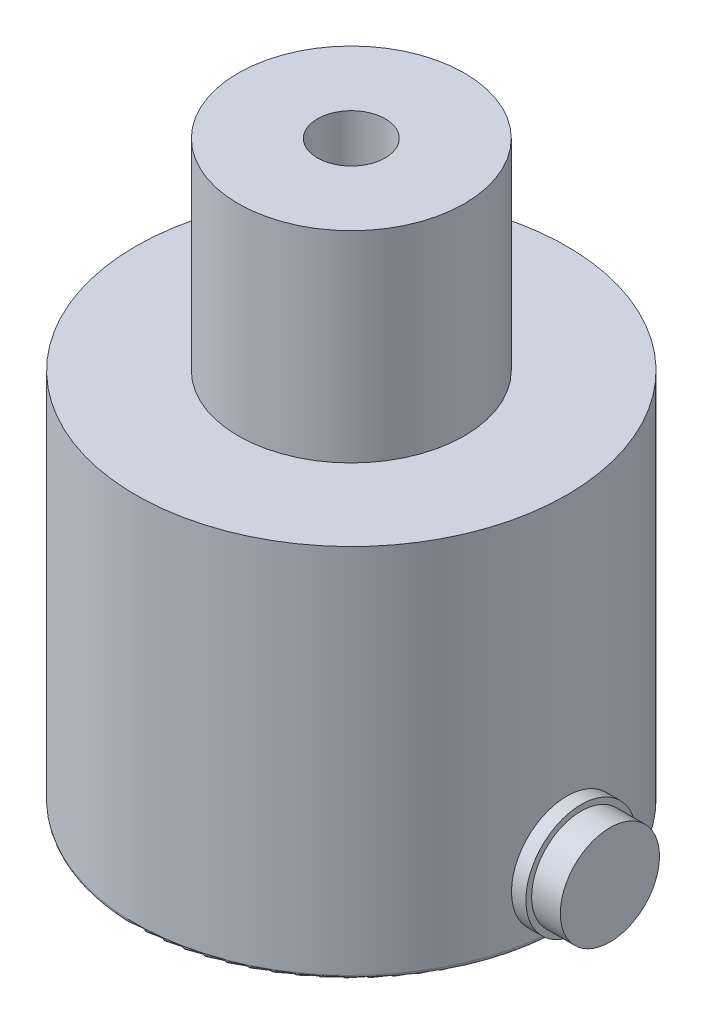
ISO-10303-21;
HEADER;
FILE_DESCRIPTION(('STEP AP214'),'2;1');
FILE_NAME('part.step','',(''),(''),'','','');
FILE_SCHEMA(('AUTOMOTIVE_DESIGN { 1 0 10303 214 1 1 1 1 }'));
ENDSEC;
DATA;
#1=APPLICATION_CONTEXT('core data for automotive mechanical design processes');
#2=APPLICATION_PROTOCOL_DEFINITION('international standard','automotive_design',2000,#1);
#3=PRODUCT_CONTEXT('',#1,'mechanical');
#4=PRODUCT('Part','Part','',(#3));
#5=PRODUCT_RELATED_PRODUCT_CATEGORY('part','',(#4));
#6=PRODUCT_DEFINITION_FORMATION('','',#4);
#7=PRODUCT_DEFINITION_CONTEXT('part definition',#1,'design');
#8=PRODUCT_DEFINITION('design','',#6,#7);
#9=PRODUCT_DEFINITION_SHAPE('','',#8);
#10=(LENGTH_UNIT() NAMED_UNIT(*) SI_UNIT(.MILLI.,.METRE.));
#11=(NAMED_UNIT(*) PLANE_ANGLE_UNIT() SI_UNIT($,.RADIAN.));
#12=(NAMED_UNIT(*) SI_UNIT($,.STERADIAN.) SOLID_ANGLE_UNIT());
#13=UNCERTAINTY_MEASURE_WITH_UNIT(LENGTH_MEASURE(1.E-05),#10,'distance_accuracy_value','');
#14=(GEOMETRIC_REPRESENTATION_CONTEXT(3) GLOBAL_UNCERTAINTY_ASSIGNED_CONTEXT((#13)) GLOBAL_UNIT_ASSIGNED_CONTEXT((#10,
#11,#12)) REPRESENTATION_CONTEXT('',''));
#15=CARTESIAN_POINT('',(0.,0.,0.));
#16=DIRECTION('',(0.,0.,1.));
#17=DIRECTION('',(1.,0.,0.));
#18=AXIS2_PLACEMENT_3D('',#15,#16,#17);
#19=CARTESIAN_POINT('',(19.05,-11.33,0.));
#20=DIRECTION('',(-1.,0.,0.));
#21=DIRECTION('',(0.,0.,1.));
#22=AXIS2_PLACEMENT_3D('',#19,#20,#21);
#23=CYLINDRICAL_SURFACE('',#22,4.38150000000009);
#24=CARTESIAN_POINT('',(22.86,-11.33,0.));
#25=DIRECTION('',(-1.,0.,0.));
#26=DIRECTION('',(0.,0.,1.));
#27=AXIS2_PLACEMENT_3D('',#24,#25,#26);
#28=CIRCLE('',#27,4.38150000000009);
#29=CARTESIAN_POINT('',(22.86,-11.33,4.38150000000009));
#30=VERTEX_POINT('',#29);
#31=EDGE_CURVE('E63',#30,#30,#28,.T.);
#32=ORIENTED_EDGE('',*,*,#31,.T.);
#33=EDGE_LOOP('',(#32));
#34=FACE_BOUND('',#33,.T.);
#35=CARTESIAN_POINT('',(20.32,-11.33,0.));
#36=DIRECTION('',(-1.,0.,0.));
#37=DIRECTION('',(0.,0.,1.));
#38=AXIS2_PLACEMENT_3D('',#35,#36,#37);
#39=CIRCLE('',#38,4.38150000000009);
#40=CARTESIAN_POINT('',(20.32,-11.33,4.38150000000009));
#41=VERTEX_POINT('',#40);
#42=EDGE_CURVE('E11',#41,#41,#39,.T.);
#43=ORIENTED_EDGE('',*,*,#42,.F.);
#44=EDGE_LOOP('',(#43));
#45=FACE_BOUND('',#44,.T.);
#46=ADVANCED_FACE('F49',(#34,#45),#23,.T.);
#47=CARTESIAN_POINT('',(20.32,0.,0.));
#48=DIRECTION('',(1.,0.,0.));
#49=DIRECTION('',(0.,0.,-1.));
#50=AXIS2_PLACEMENT_3D('',#47,#48,#49);
#51=PLANE('',#50);
#52=ORIENTED_EDGE('',*,*,#42,.T.);
#53=EDGE_LOOP('',(#52));
#54=FACE_BOUND('',#53,.T.);
#55=CARTESIAN_POINT('',(20.32,-11.33,0.));
#56=DIRECTION('',(-1.,0.,0.));
#57=DIRECTION('',(0.,0.,1.));
#58=AXIS2_PLACEMENT_3D('',#55,#56,#57);
#59=CIRCLE('',#58,4.88950000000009);
#60=CARTESIAN_POINT('',(20.32,-11.33,4.88950000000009));
#61=VERTEX_POINT('',#60);
#62=EDGE_CURVE('E55',#61,#61,#59,.T.);
#63=ORIENTED_EDGE('',*,*,#62,.F.);
#64=EDGE_LOOP('',(#63));
#65=FACE_BOUND('',#64,.T.);
#66=ADVANCED_FACE('F82',(#54,#65),#51,.T.);
#67=CARTESIAN_POINT('',(19.05,-11.33,0.));
#68=DIRECTION('',(-1.,0.,0.));
#69=DIRECTION('',(0.,0.,1.));
#70=AXIS2_PLACEMENT_3D('',#67,#68,#69);
#71=CYLINDRICAL_SURFACE('',#70,4.88950000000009);
#72=ORIENTED_EDGE('',*,*,#62,.T.);
#73=EDGE_LOOP('',(#72));
#74=FACE_BOUND('',#73,.T.);
#75=CARTESIAN_POINT('',(19.05,-11.33,0.));
#76=DIRECTION('',(-1.,0.,0.));
#77=DIRECTION('',(0.,0.,1.));
#78=AXIS2_PLACEMENT_3D('',#75,#76,#77);
#79=CIRCLE('',#78,4.88950000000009);
#80=CARTESIAN_POINT('',(19.05,-11.33,4.88950000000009));
#81=VERTEX_POINT('',#80);
#82=EDGE_CURVE('E59',#81,#81,#79,.T.);
#83=ORIENTED_EDGE('',*,*,#82,.F.);
#84=EDGE_LOOP('',(#83));
#85=FACE_BOUND('',#84,.T.);
#86=ADVANCED_FACE('F78',(#74,#85),#71,.T.);
#87=CARTESIAN_POINT('',(19.05,0.,0.));
#88=DIRECTION('',(1.,0.,0.));
#89=DIRECTION('',(0.,0.,-1.));
#90=AXIS2_PLACEMENT_3D('',#87,#88,#89);
#91=PLANE('',#90);
#92=ORIENTED_EDGE('',*,*,#82,.T.);
#93=EDGE_LOOP('',(#92));
#94=FACE_BOUND('',#93,.T.);
#95=ADVANCED_FACE('F73',(#94),#91,.F.);
#96=CARTESIAN_POINT('',(22.86,0.,0.));
#97=DIRECTION('',(1.,0.,0.));
#98=DIRECTION('',(0.,0.,-1.));
#99=AXIS2_PLACEMENT_3D('',#96,#97,#98);
#100=PLANE('',#99);
#101=ORIENTED_EDGE('',*,*,#31,.F.);
#102=EDGE_LOOP('',(#101));
#103=FACE_BOUND('',#102,.T.);
#104=ADVANCED_FACE('F71',(#103),#100,.T.);
#105=CLOSED_SHELL('',(#46,#66,#86,#95,#104));
#106=MANIFOLD_SOLID_BREP('B2',#105);
#107=CARTESIAN_POINT('',(0.,-16.61,0.));
#108=DIRECTION('',(0.,-1.,0.));
#109=DIRECTION('',(1.,0.,0.));
#110=AXIS2_PLACEMENT_3D('',#107,#108,#109);
#111=PLANE('',#110);
#112=CARTESIAN_POINT('',(0.,-16.61,0.));
#113=DIRECTION('',(0.,-1.,0.));
#114=DIRECTION('',(1.,0.,0.));
#115=AXIS2_PLACEMENT_3D('',#112,#113,#114);
#116=CIRCLE('',#115,18.6595000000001);
#117=CARTESIAN_POINT('',(18.6595000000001,-16.61,0.));
#118=VERTEX_POINT('',#117);
#119=EDGE_CURVE('E48',#118,#118,#116,.T.);
#120=ORIENTED_EDGE('',*,*,#119,.T.);
#121=EDGE_LOOP('',(#120));
#122=FACE_BOUND('',#121,.T.);
#123=ADVANCED_FACE('F129',(#122),#111,.T.);
#124=CARTESIAN_POINT('',(0.,-16.2195000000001,0.));
#125=DIRECTION('',(0.,-1.,0.));
#126=DIRECTION('',(1.,0.,0.));
#127=AXIS2_PLACEMENT_3D('',#124,#125,#126);
#128=TOROIDAL_SURFACE('',#127,18.6595000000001,0.390499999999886);
#129=CARTESIAN_POINT('',(0.,-16.2195000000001,0.));
#130=DIRECTION('',(0.,-1.,0.));
#131=DIRECTION('',(1.,0.,0.));
#132=AXIS2_PLACEMENT_3D('',#129,#130,#131);
#133=CIRCLE('',#132,19.05);
#134=CARTESIAN_POINT('',(19.05,-16.2195000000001,0.));
#135=VERTEX_POINT('',#134);
#136=EDGE_CURVE('E135',#135,#135,#133,.T.);
#137=ORIENTED_EDGE('',*,*,#136,.T.);
#138=EDGE_LOOP('',(#137));
#139=FACE_BOUND('',#138,.T.);
#140=ORIENTED_EDGE('',*,*,#119,.F.);
#141=EDGE_LOOP('',(#140));
#142=FACE_BOUND('',#141,.T.);
#143=ADVANCED_FACE('F170',(#139,#142),#128,.T.);
#144=CARTESIAN_POINT('',(0.,0.,0.));
#145=DIRECTION('',(0.,-1.,0.));
#146=DIRECTION('',(1.,0.,0.));
#147=AXIS2_PLACEMENT_3D('',#144,#145,#146);
#148=CYLINDRICAL_SURFACE('',#147,19.05);
#149=ORIENTED_EDGE('',*,*,#136,.F.);
#150=EDGE_LOOP('',(#149));
#151=FACE_BOUND('',#150,.T.);
#152=CARTESIAN_POINT('',(0.,16.61,0.));
#153=DIRECTION('',(0.,-1.,0.));
#154=DIRECTION('',(1.,0.,0.));
#155=AXIS2_PLACEMENT_3D('',#152,#153,#154);
#156=CIRCLE('',#155,19.05);
#157=CARTESIAN_POINT('',(19.05,16.61,0.));
#158=VERTEX_POINT('',#157);
#159=EDGE_CURVE('E139',#158,#158,#156,.T.);
#160=ORIENTED_EDGE('',*,*,#159,.T.);
#161=EDGE_LOOP('',(#160));
#162=FACE_BOUND('',#161,.T.);
#163=ADVANCED_FACE('F174',(#151,#162),#148,.T.);
#164=CARTESIAN_POINT('',(0.,16.61,0.));
#165=DIRECTION('',(0.,-1.,0.));
#166=DIRECTION('',(1.,0.,0.));
#167=AXIS2_PLACEMENT_3D('',#164,#165,#166);
#168=PLANE('',#167);
#169=ORIENTED_EDGE('',*,*,#159,.F.);
#170=EDGE_LOOP('',(#169));
#171=FACE_BOUND('',#170,.T.);
#172=CARTESIAN_POINT('',(0.,16.61,0.));
#173=DIRECTION('',(0.,-1.,0.));
#174=DIRECTION('',(1.,0.,0.));
#175=AXIS2_PLACEMENT_3D('',#172,#173,#174);
#176=CIRCLE('',#175,10.);
#177=CARTESIAN_POINT('',(10.,16.61,0.));
#178=VERTEX_POINT('',#177);
#179=EDGE_CURVE('E143',#178,#178,#176,.T.);
#180=ORIENTED_EDGE('',*,*,#179,.T.);
#181=EDGE_LOOP('',(#180));
#182=FACE_BOUND('',#181,.T.);
#183=ADVANCED_FACE('F178',(#171,#182),#168,.F.);
#184=CARTESIAN_POINT('',(0.,0.,0.));
#185=DIRECTION('',(0.,-1.,0.));
#186=DIRECTION('',(1.,0.,0.));
#187=AXIS2_PLACEMENT_3D('',#184,#185,#186);
#188=CYLINDRICAL_SURFACE('',#187,10.);
#189=ORIENTED_EDGE('',*,*,#179,.F.);
#190=EDGE_LOOP('',(#189));
#191=FACE_BOUND('',#190,.T.);
#192=CARTESIAN_POINT('',(0.,34.39,0.));
#193=DIRECTION('',(0.,-1.,0.));
#194=DIRECTION('',(1.,0.,0.));
#195=AXIS2_PLACEMENT_3D('',#192,#193,#194);
#196=CIRCLE('',#195,10.);
#197=CARTESIAN_POINT('',(10.,34.39,0.));
#198=VERTEX_POINT('',#197);
#199=EDGE_CURVE('E148',#198,#198,#196,.T.);
#200=ORIENTED_EDGE('',*,*,#199,.T.);
#201=EDGE_LOOP('',(#200));
#202=FACE_BOUND('',#201,.T.);
#203=ADVANCED_FACE('F185',(#191,#202),#188,.T.);
#204=CARTESIAN_POINT('',(0.,34.39,0.));
#205=DIRECTION('',(0.,1.,0.));
#206=DIRECTION('',(-1.,0.,0.));
#207=AXIS2_PLACEMENT_3D('',#204,#205,#206);
#208=PLANE('',#207);
#209=CARTESIAN_POINT('',(0.,34.39,0.));
#210=DIRECTION('',(0.,-1.,0.));
#211=DIRECTION('',(1.,0.,0.));
#212=AXIS2_PLACEMENT_3D('',#209,#210,#211);
#213=CIRCLE('',#212,3.);
#214=CARTESIAN_POINT('',(3.,34.39,0.));
#215=VERTEX_POINT('',#214);
#216=EDGE_CURVE('E151',#215,#215,#213,.T.);
#217=ORIENTED_EDGE('',*,*,#216,.T.);
#218=EDGE_LOOP('',(#217));
#219=FACE_BOUND('',#218,.T.);
#220=ORIENTED_EDGE('',*,*,#199,.F.);
#221=EDGE_LOOP('',(#220));
#222=FACE_BOUND('',#221,.T.);
#223=ADVANCED_FACE('F167',(#219,#222),#208,.T.);
#224=CARTESIAN_POINT('',(0.,0.,0.));
#225=DIRECTION('',(0.,-1.,0.));
#226=DIRECTION('',(1.,0.,0.));
#227=AXIS2_PLACEMENT_3D('',#224,#225,#226);
#228=CYLINDRICAL_SURFACE('',#227,3.);
#229=CARTESIAN_POINT('',(0.,21.69,0.));
#230=DIRECTION('',(0.,-1.,0.));
#231=DIRECTION('',(1.,0.,0.));
#232=AXIS2_PLACEMENT_3D('',#229,#230,#231);
#233=CIRCLE('',#232,3.);
#234=CARTESIAN_POINT('',(3.,21.69,0.));
#235=VERTEX_POINT('',#234);
#236=EDGE_CURVE('E154',#235,#235,#233,.T.);
#237=ORIENTED_EDGE('',*,*,#236,.T.);
#238=EDGE_LOOP('',(#237));
#239=FACE_BOUND('',#238,.T.);
#240=ORIENTED_EDGE('',*,*,#216,.F.);
#241=EDGE_LOOP('',(#240));
#242=FACE_BOUND('',#241,.T.);
#243=ADVANCED_FACE('F158',(#239,#242),#228,.F.);
#244=CARTESIAN_POINT('',(0.,21.69,0.));
#245=DIRECTION('',(0.,1.,0.));
#246=DIRECTION('',(-1.,0.,0.));
#247=AXIS2_PLACEMENT_3D('',#244,#245,#246);
#248=PLANE('',#247);
#249=ORIENTED_EDGE('',*,*,#236,.F.);
#250=EDGE_LOOP('',(#249));
#251=FACE_BOUND('',#250,.T.);
#252=ADVANCED_FACE('F161',(#251),#248,.T.);
#253=CLOSED_SHELL('',(#123,#143,#163,#183,#203,#223,#243,#252));
#254=MANIFOLD_SOLID_BREP('B6',#253);
#255=ADVANCED_BREP_SHAPE_REPRESENTATION('',(#18,#106,#254),#14);
#256=SHAPE_DEFINITION_REPRESENTATION(#9,#255);
ENDSEC;
END-ISO-10303-21;
